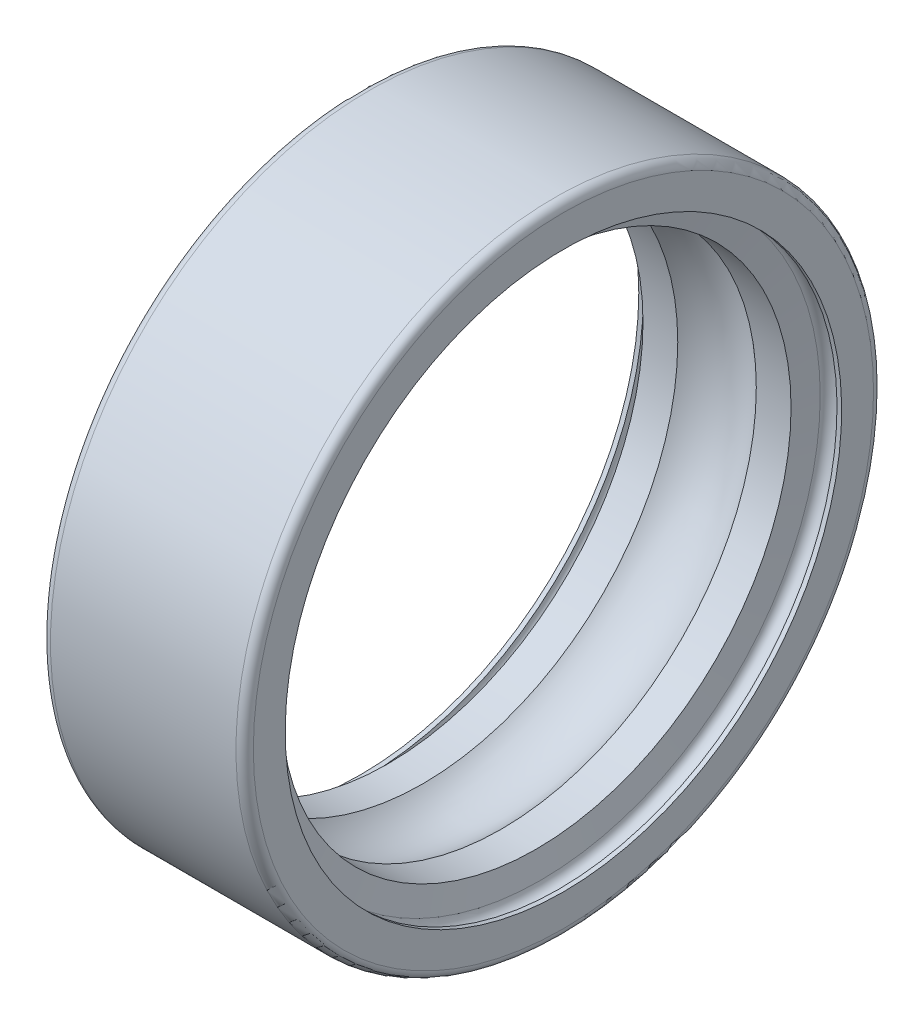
ISO-10303-21;
HEADER;
FILE_DESCRIPTION(('STEP AP214'),'2;1');
FILE_NAME('part.step','',(''),(''),'','','');
FILE_SCHEMA(('AUTOMOTIVE_DESIGN { 1 0 10303 214 1 1 1 1 }'));
ENDSEC;
DATA;
#1=APPLICATION_CONTEXT('core data for automotive mechanical design processes');
#2=APPLICATION_PROTOCOL_DEFINITION('international standard','automotive_design',2000,#1);
#3=PRODUCT_CONTEXT('',#1,'mechanical');
#4=PRODUCT('Part','Part','',(#3));
#5=PRODUCT_RELATED_PRODUCT_CATEGORY('part','',(#4));
#6=PRODUCT_DEFINITION_FORMATION('','',#4);
#7=PRODUCT_DEFINITION_CONTEXT('part definition',#1,'design');
#8=PRODUCT_DEFINITION('design','',#6,#7);
#9=PRODUCT_DEFINITION_SHAPE('','',#8);
#10=(LENGTH_UNIT() NAMED_UNIT(*) SI_UNIT(.MILLI.,.METRE.));
#11=(NAMED_UNIT(*) PLANE_ANGLE_UNIT() SI_UNIT($,.RADIAN.));
#12=(NAMED_UNIT(*) SI_UNIT($,.STERADIAN.) SOLID_ANGLE_UNIT());
#13=UNCERTAINTY_MEASURE_WITH_UNIT(LENGTH_MEASURE(1.E-05),#10,'distance_accuracy_value','');
#14=(GEOMETRIC_REPRESENTATION_CONTEXT(3) GLOBAL_UNCERTAINTY_ASSIGNED_CONTEXT((#13)) GLOBAL_UNIT_ASSIGNED_CONTEXT((#10,
#11,#12)) REPRESENTATION_CONTEXT('',''));
#15=CARTESIAN_POINT('',(0.,0.,0.));
#16=DIRECTION('',(0.,0.,1.));
#17=DIRECTION('',(1.,0.,0.));
#18=AXIS2_PLACEMENT_3D('',#15,#16,#17);
#19=CARTESIAN_POINT('',(7.,10.15,0.));
#20=DIRECTION('',(1.,0.,0.));
#21=DIRECTION('',(0.,1.,0.));
#22=AXIS2_PLACEMENT_3D('',#19,#20,#21);
#23=PLANE('',#22);
#24=CARTESIAN_POINT('',(7.,0.,0.));
#25=DIRECTION('',(1.,0.,0.));
#26=DIRECTION('',(0.,1.,0.));
#27=AXIS2_PLACEMENT_3D('',#24,#25,#26);
#28=CIRCLE('',#27,9.6);
#29=CARTESIAN_POINT('',(7.,-9.6,0.));
#30=VERTEX_POINT('',#29);
#31=EDGE_CURVE('E104',#30,#30,#28,.T.);
#32=ORIENTED_EDGE('',*,*,#31,.F.);
#33=EDGE_LOOP('',(#32));
#34=FACE_BOUND('',#33,.T.);
#35=CARTESIAN_POINT('',(7.,0.,0.));
#36=DIRECTION('',(1.,0.,0.));
#37=DIRECTION('',(0.,1.,0.));
#38=AXIS2_PLACEMENT_3D('',#35,#36,#37);
#39=CIRCLE('',#38,10.7);
#40=CARTESIAN_POINT('',(7.,0.,10.7));
#41=VERTEX_POINT('',#40);
#42=EDGE_CURVE('E95',#41,#41,#39,.T.);
#43=ORIENTED_EDGE('',*,*,#42,.T.);
#44=EDGE_LOOP('',(#43));
#45=FACE_BOUND('',#44,.T.);
#46=ADVANCED_FACE('F17',(#34,#45),#23,.T.);
#47=CARTESIAN_POINT('',(0.,10.15,0.));
#48=DIRECTION('',(-1.,0.,0.));
#49=DIRECTION('',(0.,0.,1.));
#50=AXIS2_PLACEMENT_3D('',#47,#48,#49);
#51=PLANE('',#50);
#52=CARTESIAN_POINT('',(0.,0.,0.));
#53=DIRECTION('',(1.,0.,0.));
#54=DIRECTION('',(0.,1.,0.));
#55=AXIS2_PLACEMENT_3D('',#52,#53,#54);
#56=CIRCLE('',#55,9.6);
#57=CARTESIAN_POINT('',(0.,-9.6,0.));
#58=VERTEX_POINT('',#57);
#59=EDGE_CURVE('E111',#58,#58,#56,.T.);
#60=ORIENTED_EDGE('',*,*,#59,.T.);
#61=EDGE_LOOP('',(#60));
#62=FACE_BOUND('',#61,.T.);
#63=CARTESIAN_POINT('',(0.,0.,0.));
#64=DIRECTION('',(1.,0.,0.));
#65=DIRECTION('',(0.,1.,0.));
#66=AXIS2_PLACEMENT_3D('',#63,#64,#65);
#67=CIRCLE('',#66,10.7);
#68=CARTESIAN_POINT('',(0.,0.,10.7));
#69=VERTEX_POINT('',#68);
#70=EDGE_CURVE('E101',#69,#69,#67,.T.);
#71=ORIENTED_EDGE('',*,*,#70,.F.);
#72=EDGE_LOOP('',(#71));
#73=FACE_BOUND('',#72,.T.);
#74=ADVANCED_FACE('F127',(#62,#73),#51,.T.);
#75=CARTESIAN_POINT('',(6.12943170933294,0.,0.));
#76=DIRECTION('',(1.,0.,0.));
#77=DIRECTION('',(0.,1.,0.));
#78=AXIS2_PLACEMENT_3D('',#75,#76,#77);
#79=CONICAL_SURFACE('',#78,9.22778370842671,1.39626340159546);
#80=CARTESIAN_POINT('',(6.05400189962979,0.,0.));
#81=DIRECTION('',(1.,0.,0.));
#82=DIRECTION('',(0.,1.,0.));
#83=AXIS2_PLACEMENT_3D('',#80,#81,#82);
#84=CIRCLE('',#83,8.8);
#85=CARTESIAN_POINT('',(6.05400189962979,-8.8,0.));
#86=VERTEX_POINT('',#85);
#87=EDGE_CURVE('E11',#86,#86,#84,.T.);
#88=ORIENTED_EDGE('',*,*,#87,.F.);
#89=EDGE_LOOP('',(#88));
#90=FACE_BOUND('',#89,.T.);
#91=CARTESIAN_POINT('',(6.20486151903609,0.,0.));
#92=DIRECTION('',(1.,0.,0.));
#93=DIRECTION('',(0.,1.,0.));
#94=AXIS2_PLACEMENT_3D('',#91,#92,#93);
#95=CIRCLE('',#94,9.65556741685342);
#96=CARTESIAN_POINT('',(6.20486151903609,9.65556741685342,0.));
#97=VERTEX_POINT('',#96);
#98=EDGE_CURVE('E190',#97,#97,#95,.T.);
#99=ORIENTED_EDGE('',*,*,#98,.T.);
#100=EDGE_LOOP('',(#99));
#101=FACE_BOUND('',#100,.T.);
#102=ADVANCED_FACE('F151',(#90,#101),#79,.F.);
#103=CARTESIAN_POINT('',(5.45444841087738,0.,0.));
#104=DIRECTION('',(1.,0.,0.));
#105=DIRECTION('',(0.,1.,0.));
#106=AXIS2_PLACEMENT_3D('',#103,#104,#105);
#107=CYLINDRICAL_SURFACE('',#106,8.8);
#108=CARTESIAN_POINT('',(4.85489492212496,0.,0.));
#109=DIRECTION('',(1.,0.,0.));
#110=DIRECTION('',(0.,1.,0.));
#111=AXIS2_PLACEMENT_3D('',#108,#109,#110);
#112=CIRCLE('',#111,8.8);
#113=CARTESIAN_POINT('',(4.85489492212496,-8.8,0.));
#114=VERTEX_POINT('',#113);
#115=EDGE_CURVE('E116',#114,#114,#112,.T.);
#116=ORIENTED_EDGE('',*,*,#115,.F.);
#117=EDGE_LOOP('',(#116));
#118=FACE_BOUND('',#117,.T.);
#119=ORIENTED_EDGE('',*,*,#87,.T.);
#120=EDGE_LOOP('',(#119));
#121=FACE_BOUND('',#120,.T.);
#122=ADVANCED_FACE('F155',(#118,#121),#107,.F.);
#123=CARTESIAN_POINT('',(1.54555158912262,0.,0.));
#124=DIRECTION('',(1.,0.,0.));
#125=DIRECTION('',(0.,1.,0.));
#126=AXIS2_PLACEMENT_3D('',#123,#124,#125);
#127=CYLINDRICAL_SURFACE('',#126,8.8);
#128=CARTESIAN_POINT('',(0.945998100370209,0.,0.));
#129=DIRECTION('',(1.,0.,0.));
#130=DIRECTION('',(0.,1.,0.));
#131=AXIS2_PLACEMENT_3D('',#128,#129,#130);
#132=CIRCLE('',#131,8.8);
#133=CARTESIAN_POINT('',(0.945998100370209,-8.8,0.));
#134=VERTEX_POINT('',#133);
#135=EDGE_CURVE('E28',#134,#134,#132,.T.);
#136=ORIENTED_EDGE('',*,*,#135,.F.);
#137=EDGE_LOOP('',(#136));
#138=FACE_BOUND('',#137,.T.);
#139=CARTESIAN_POINT('',(2.14510507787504,0.,0.));
#140=DIRECTION('',(1.,0.,0.));
#141=DIRECTION('',(0.,1.,0.));
#142=AXIS2_PLACEMENT_3D('',#139,#140,#141);
#143=CIRCLE('',#142,8.8);
#144=CARTESIAN_POINT('',(2.14510507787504,0.,8.8));
#145=VERTEX_POINT('',#144);
#146=EDGE_CURVE('E21',#145,#145,#143,.T.);
#147=ORIENTED_EDGE('',*,*,#146,.T.);
#148=EDGE_LOOP('',(#147));
#149=FACE_BOUND('',#148,.T.);
#150=ADVANCED_FACE('F19',(#138,#149),#127,.F.);
#151=CARTESIAN_POINT('',(0.870568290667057,0.,0.));
#152=DIRECTION('',(-1.,0.,0.));
#153=DIRECTION('',(0.,1.,0.));
#154=AXIS2_PLACEMENT_3D('',#151,#152,#153);
#155=CONICAL_SURFACE('',#154,9.22778370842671,1.39626340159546);
#156=CARTESIAN_POINT('',(0.795138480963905,0.,0.));
#157=DIRECTION('',(1.,0.,0.));
#158=DIRECTION('',(0.,1.,0.));
#159=AXIS2_PLACEMENT_3D('',#156,#157,#158);
#160=CIRCLE('',#159,9.65556741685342);
#161=CARTESIAN_POINT('',(0.795138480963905,-9.65556741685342,0.));
#162=VERTEX_POINT('',#161);
#163=EDGE_CURVE('E54',#162,#162,#160,.T.);
#164=ORIENTED_EDGE('',*,*,#163,.F.);
#165=EDGE_LOOP('',(#164));
#166=FACE_BOUND('',#165,.T.);
#167=ORIENTED_EDGE('',*,*,#135,.T.);
#168=EDGE_LOOP('',(#167));
#169=FACE_BOUND('',#168,.T.);
#170=ADVANCED_FACE('F133',(#166,#169),#155,.F.);
#171=CARTESIAN_POINT('',(0.08,0.,0.));
#172=DIRECTION('',(1.,0.,0.));
#173=DIRECTION('',(0.,1.,0.));
#174=AXIS2_PLACEMENT_3D('',#171,#172,#173);
#175=CYLINDRICAL_SURFACE('',#174,9.6);
#176=ORIENTED_EDGE('',*,*,#59,.F.);
#177=EDGE_LOOP('',(#176));
#178=FACE_BOUND('',#177,.T.);
#179=CARTESIAN_POINT('',(0.16,0.,0.));
#180=DIRECTION('',(1.,0.,0.));
#181=DIRECTION('',(0.,1.,0.));
#182=AXIS2_PLACEMENT_3D('',#179,#180,#181);
#183=CIRCLE('',#182,9.6);
#184=CARTESIAN_POINT('',(0.16,0.,9.6));
#185=VERTEX_POINT('',#184);
#186=EDGE_CURVE('E66',#185,#185,#183,.T.);
#187=ORIENTED_EDGE('',*,*,#186,.T.);
#188=EDGE_LOOP('',(#187));
#189=FACE_BOUND('',#188,.T.);
#190=ADVANCED_FACE('F130',(#178,#189),#175,.F.);
#191=CARTESIAN_POINT('',(0.3,0.,0.));
#192=DIRECTION('',(1.,0.,0.));
#193=DIRECTION('',(0.,0.,-1.));
#194=AXIS2_PLACEMENT_3D('',#191,#192,#193);
#195=TOROIDAL_SURFACE('',#194,10.7,0.3);
#196=ORIENTED_EDGE('',*,*,#70,.T.);
#197=EDGE_LOOP('',(#196));
#198=FACE_BOUND('',#197,.T.);
#199=CARTESIAN_POINT('',(0.3,0.,0.));
#200=DIRECTION('',(1.,0.,0.));
#201=DIRECTION('',(0.,1.,0.));
#202=AXIS2_PLACEMENT_3D('',#199,#200,#201);
#203=CIRCLE('',#202,11.);
#204=CARTESIAN_POINT('',(0.3,0.,-11.));
#205=VERTEX_POINT('',#204);
#206=EDGE_CURVE('E94',#205,#205,#203,.T.);
#207=ORIENTED_EDGE('',*,*,#206,.F.);
#208=EDGE_LOOP('',(#207));
#209=FACE_BOUND('',#208,.T.);
#210=ADVANCED_FACE('F132',(#198,#209),#195,.T.);
#211=CARTESIAN_POINT('',(3.5,0.,0.));
#212=DIRECTION('',(1.,0.,0.));
#213=DIRECTION('',(0.,1.,0.));
#214=AXIS2_PLACEMENT_3D('',#211,#212,#213);
#215=CYLINDRICAL_SURFACE('',#214,11.);
#216=ORIENTED_EDGE('',*,*,#206,.T.);
#217=EDGE_LOOP('',(#216));
#218=FACE_BOUND('',#217,.T.);
#219=CARTESIAN_POINT('',(6.7,0.,0.));
#220=DIRECTION('',(1.,0.,0.));
#221=DIRECTION('',(0.,1.,0.));
#222=AXIS2_PLACEMENT_3D('',#219,#220,#221);
#223=CIRCLE('',#222,11.);
#224=CARTESIAN_POINT('',(6.7,-11.,0.));
#225=VERTEX_POINT('',#224);
#226=EDGE_CURVE('E89',#225,#225,#223,.T.);
#227=ORIENTED_EDGE('',*,*,#226,.F.);
#228=EDGE_LOOP('',(#227));
#229=FACE_BOUND('',#228,.T.);
#230=ADVANCED_FACE('F139',(#218,#229),#215,.T.);
#231=CARTESIAN_POINT('',(6.7,0.,0.));
#232=DIRECTION('',(1.,0.,0.));
#233=DIRECTION('',(0.,0.,-1.));
#234=AXIS2_PLACEMENT_3D('',#231,#232,#233);
#235=TOROIDAL_SURFACE('',#234,10.7,0.3);
#236=ORIENTED_EDGE('',*,*,#226,.T.);
#237=EDGE_LOOP('',(#236));
#238=FACE_BOUND('',#237,.T.);
#239=ORIENTED_EDGE('',*,*,#42,.F.);
#240=EDGE_LOOP('',(#239));
#241=FACE_BOUND('',#240,.T.);
#242=ADVANCED_FACE('F90',(#238,#241),#235,.T.);
#243=CARTESIAN_POINT('',(6.92,0.,0.));
#244=DIRECTION('',(1.,0.,0.));
#245=DIRECTION('',(0.,1.,0.));
#246=AXIS2_PLACEMENT_3D('',#243,#244,#245);
#247=CYLINDRICAL_SURFACE('',#246,9.6);
#248=CARTESIAN_POINT('',(6.84,0.,0.));
#249=DIRECTION('',(1.,0.,0.));
#250=DIRECTION('',(0.,1.,0.));
#251=AXIS2_PLACEMENT_3D('',#248,#249,#250);
#252=CIRCLE('',#251,9.6);
#253=CARTESIAN_POINT('',(6.84,-9.6,0.));
#254=VERTEX_POINT('',#253);
#255=EDGE_CURVE('E120',#254,#254,#252,.T.);
#256=ORIENTED_EDGE('',*,*,#255,.F.);
#257=EDGE_LOOP('',(#256));
#258=FACE_BOUND('',#257,.T.);
#259=ORIENTED_EDGE('',*,*,#31,.T.);
#260=EDGE_LOOP('',(#259));
#261=FACE_BOUND('',#260,.T.);
#262=ADVANCED_FACE('F170',(#258,#261),#247,.F.);
#263=CARTESIAN_POINT('',(3.5,0.,0.));
#264=DIRECTION('',(1.,0.,0.));
#265=DIRECTION('',(0.,0.,-1.));
#266=AXIS2_PLACEMENT_3D('',#263,#264,#265);
#267=TOROIDAL_SURFACE('',#266,7.35,1.9845);
#268=ORIENTED_EDGE('',*,*,#115,.T.);
#269=EDGE_LOOP('',(#268));
#270=FACE_BOUND('',#269,.T.);
#271=ORIENTED_EDGE('',*,*,#146,.F.);
#272=EDGE_LOOP('',(#271));
#273=FACE_BOUND('',#272,.T.);
#274=ADVANCED_FACE('F166',(#270,#273),#267,.F.);
#275=CARTESIAN_POINT('',(0.48,0.,0.));
#276=DIRECTION('',(1.,0.,0.));
#277=DIRECTION('',(0.,0.,-1.));
#278=AXIS2_PLACEMENT_3D('',#275,#276,#277);
#279=TOROIDAL_SURFACE('',#278,9.6,0.32);
#280=ORIENTED_EDGE('',*,*,#163,.T.);
#281=EDGE_LOOP('',(#280));
#282=FACE_BOUND('',#281,.T.);
#283=ORIENTED_EDGE('',*,*,#186,.F.);
#284=EDGE_LOOP('',(#283));
#285=FACE_BOUND('',#284,.T.);
#286=ADVANCED_FACE('F162',(#282,#285),#279,.F.);
#287=CARTESIAN_POINT('',(6.52,0.,0.));
#288=DIRECTION('',(1.,0.,0.));
#289=DIRECTION('',(0.,0.,-1.));
#290=AXIS2_PLACEMENT_3D('',#287,#288,#289);
#291=TOROIDAL_SURFACE('',#290,9.6,0.32);
#292=ORIENTED_EDGE('',*,*,#255,.T.);
#293=EDGE_LOOP('',(#292));
#294=FACE_BOUND('',#293,.T.);
#295=ORIENTED_EDGE('',*,*,#98,.F.);
#296=EDGE_LOOP('',(#295));
#297=FACE_BOUND('',#296,.T.);
#298=ADVANCED_FACE('F165',(#294,#297),#291,.F.);
#299=CLOSED_SHELL('',(#46,#74,#102,#122,#150,#170,#190,#210,#230,#242,#262,#274,#286,#298));
#300=MANIFOLD_SOLID_BREP('B1',#299);
#301=ADVANCED_BREP_SHAPE_REPRESENTATION('',(#18,#300),#14);
#302=SHAPE_DEFINITION_REPRESENTATION(#9,#301);
ENDSEC;
END-ISO-10303-21;
